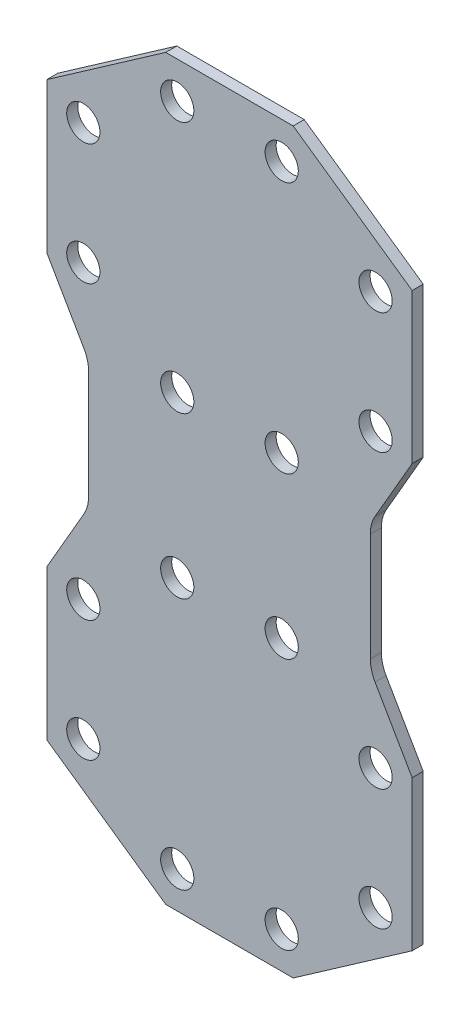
from build123d import *

# Parameters (mm, degrees)
MAIN_PLATE_DEPTH   = 31.75
SKETCH5_R          = 47.625
CUT_EXTRUDE1_DEPTH = 31.75


with BuildPart() as part:
    # Sketch3 → Main Plate (new body)
    with BuildSketch(Plane(origin=(0, 0, 0), x_dir=(0, 1, 0), z_dir=(0, 0, 1))):
        with BuildLine():
            Line((201.663107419, -523.855268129), (-228.234235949, -523.855268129))
            Line((-228.234235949, -523.855268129), (-466.324268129, -182.70492307))
            Line((-466.324268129, -182.70492307), (-466.324268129, 182.70492307))
            Line((-466.324268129, 182.70492307), (-228.234235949, 523.855268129))
            Line((-228.234235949, 523.855268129), (201.663107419, 523.855268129))
            Line((201.663107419, 523.855268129), (385.932842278, 417.467087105))
            ThreePointArc((385.932842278, 417.467087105), (410.436827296, 407.317204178), (436.732842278, 403.855268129))
            Line((436.732842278, 403.855268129), (746.653157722, 403.855268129))
            ThreePointArc((746.653157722, 403.855268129), (772.949172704, 407.317204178), (797.453157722, 417.467087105))
            Line((797.453157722, 417.467087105), (981.722892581, 523.855268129))
            Line((981.722892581, 523.855268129), (1411.620235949, 523.855268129))
            Line((1411.620235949, 523.855268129), (1649.710268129, 182.70492307))
            Line((1649.710268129, 182.70492307), (1649.710268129, -182.70492307))
            Line((1649.710268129, -182.70492307), (1411.620235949, -523.855268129))
            Line((1411.620235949, -523.855268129), (981.722892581, -523.855268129))
            Line((981.722892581, -523.855268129), (797.453157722, -417.467087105))
            ThreePointArc((797.453157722, -417.467087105), (772.949172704, -407.317204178), (746.653157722, -403.855268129))
            Line((746.653157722, -403.855268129), (436.732842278, -403.855268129))
            ThreePointArc((436.732842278, -403.855268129), (410.436827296, -407.317204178), (385.932842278, -417.467087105))
            Line((385.932842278, -417.467087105), (201.663107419, -523.855268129))
        make_face()
    extrude(amount=MAIN_PLATE_DEPTH)

    # Sketch5 → Cut-Extrude1 (cut)
    with BuildSketch(Plane(origin=(0, 0, 0), x_dir=(0, 1, 0), z_dir=(0, 0, 1))):
        with Locations(Location((-173.588730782, 419.080268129, 0), (0, 0, 270))):
            Circle(SKETCH5_R)
        with Locations(Location((173.588730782, 419.080268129, 0), (0, 0, 270))):
            Circle(SKETCH5_R)
        with Locations(Location((361.549268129, 149.758610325, 0), (0, 0, 270))):
            Circle(SKETCH5_R)
        with Locations(Location((361.549268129, -149.758610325, 0), (0, 0, 270))):
            Circle(SKETCH5_R)
        with Locations(Location((173.588730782, -419.080268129, 0), (0, 0, 270))):
            Circle(SKETCH5_R)
        with Locations(Location((-173.588730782, -419.080268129, 0), (0, 0, 270))):
            Circle(SKETCH5_R)
        with Locations(Location((-361.549268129, -149.758610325, 0), (0, 0, 270))):
            Circle(SKETCH5_R)
        with Locations(Location((-361.549268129, 149.758610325, 0), (0, 0, 270))):
            Circle(SKETCH5_R)
        with Locations(Location((1356.974730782, 419.080268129, 0), (0, 0, 270))):
            Circle(SKETCH5_R)
        with Locations(Location((1544.935268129, -149.758610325, 0), (0, 0, 270))):
            Circle(SKETCH5_R)
        with Locations(Location((1544.935268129, 149.758610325, 0), (0, 0, 270))):
            Circle(SKETCH5_R)
        with Locations(Location((1356.974730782, -419.080268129, 0), (0, 0, 270))):
            Circle(SKETCH5_R)
        with Locations(Location((1009.797269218, -419.080268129, 0), (0, 0, 270))):
            Circle(SKETCH5_R)
        with Locations(Location((821.836731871, 149.758610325, 0), (0, 0, 270))):
            Circle(SKETCH5_R)
        with Locations(Location((1009.797269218, 419.080268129, 0), (0, 0, 270))):
            Circle(SKETCH5_R)
        with Locations(Location((821.836731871, -149.758610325, 0), (0, 0, 270))):
            Circle(SKETCH5_R)
    extrude(amount=CUT_EXTRUDE1_DEPTH, mode=Mode.SUBTRACT)


solid = part.part
